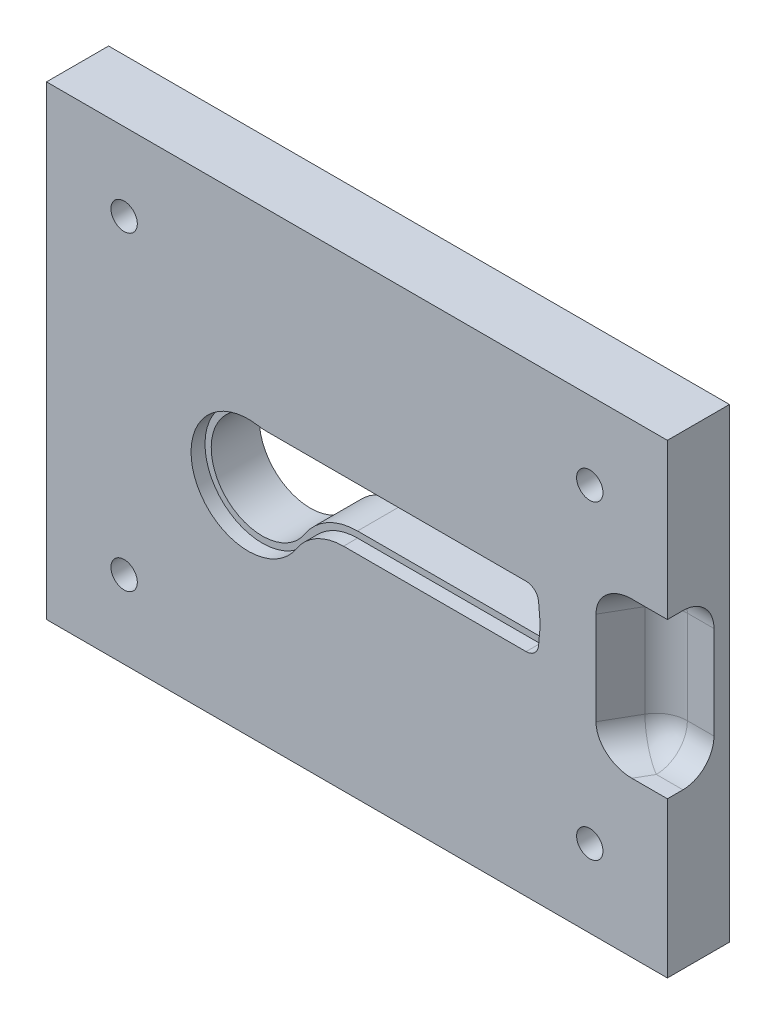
ISO-10303-21;
HEADER;
FILE_DESCRIPTION(('STEP AP214'),'2;1');
FILE_NAME('part.step','',(''),(''),'','','');
FILE_SCHEMA(('AUTOMOTIVE_DESIGN { 1 0 10303 214 1 1 1 1 }'));
ENDSEC;
DATA;
#1=APPLICATION_CONTEXT('core data for automotive mechanical design processes');
#2=APPLICATION_PROTOCOL_DEFINITION('international standard','automotive_design',2000,#1);
#3=PRODUCT_CONTEXT('',#1,'mechanical');
#4=PRODUCT('Part','Part','',(#3));
#5=PRODUCT_RELATED_PRODUCT_CATEGORY('part','',(#4));
#6=PRODUCT_DEFINITION_FORMATION('','',#4);
#7=PRODUCT_DEFINITION_CONTEXT('part definition',#1,'design');
#8=PRODUCT_DEFINITION('design','',#6,#7);
#9=PRODUCT_DEFINITION_SHAPE('','',#8);
#10=(LENGTH_UNIT() NAMED_UNIT(*) SI_UNIT(.MILLI.,.METRE.));
#11=(NAMED_UNIT(*) PLANE_ANGLE_UNIT() SI_UNIT($,.RADIAN.));
#12=(NAMED_UNIT(*) SI_UNIT($,.STERADIAN.) SOLID_ANGLE_UNIT());
#13=UNCERTAINTY_MEASURE_WITH_UNIT(LENGTH_MEASURE(1.E-05),#10,'distance_accuracy_value','');
#14=(GEOMETRIC_REPRESENTATION_CONTEXT(3) GLOBAL_UNCERTAINTY_ASSIGNED_CONTEXT((#13)) GLOBAL_UNIT_ASSIGNED_CONTEXT((#10,
#11,#12)) REPRESENTATION_CONTEXT('',''));
#15=CARTESIAN_POINT('',(0.,0.,0.));
#16=DIRECTION('',(0.,0.,1.));
#17=DIRECTION('',(1.,0.,0.));
#18=AXIS2_PLACEMENT_3D('',#15,#16,#17);
#19=CARTESIAN_POINT('',(175.,125.,20.));
#20=DIRECTION('',(0.,0.,1.));
#21=DIRECTION('',(1.,0.,0.));
#22=AXIS2_PLACEMENT_3D('',#19,#20,#21);
#23=CYLINDRICAL_SURFACE('',#22,4.24999999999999);
#24=CARTESIAN_POINT('',(175.,125.,20.));
#25=DIRECTION('',(0.,0.,1.));
#26=DIRECTION('',(1.,0.,0.));
#27=AXIS2_PLACEMENT_3D('',#24,#25,#26);
#28=CIRCLE('',#27,4.24999999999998);
#29=CARTESIAN_POINT('',(179.25,125.,20.));
#30=VERTEX_POINT('',#29);
#31=EDGE_CURVE('E268',#30,#30,#28,.T.);
#32=ORIENTED_EDGE('',*,*,#31,.T.);
#33=EDGE_LOOP('',(#32));
#34=FACE_BOUND('',#33,.T.);
#35=CARTESIAN_POINT('',(175.,125.,5.));
#36=DIRECTION('',(0.,0.,-1.));
#37=DIRECTION('',(-1.,0.,0.));
#38=AXIS2_PLACEMENT_3D('',#35,#36,#37);
#39=CIRCLE('',#38,4.24999999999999);
#40=CARTESIAN_POINT('',(170.75,125.,5.));
#41=VERTEX_POINT('',#40);
#42=EDGE_CURVE('E280',#41,#41,#39,.F.);
#43=ORIENTED_EDGE('',*,*,#42,.F.);
#44=EDGE_LOOP('',(#43));
#45=FACE_BOUND('',#44,.T.);
#46=ADVANCED_FACE('F28',(#34,#45),#23,.F.);
#47=CARTESIAN_POINT('',(175.,25.,20.));
#48=DIRECTION('',(0.,0.,1.));
#49=DIRECTION('',(1.,0.,0.));
#50=AXIS2_PLACEMENT_3D('',#47,#48,#49);
#51=CYLINDRICAL_SURFACE('',#50,4.24999999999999);
#52=CARTESIAN_POINT('',(175.,25.,20.));
#53=DIRECTION('',(0.,0.,1.));
#54=DIRECTION('',(1.,0.,0.));
#55=AXIS2_PLACEMENT_3D('',#52,#53,#54);
#56=CIRCLE('',#55,4.24999999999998);
#57=CARTESIAN_POINT('',(179.25,25.,20.));
#58=VERTEX_POINT('',#57);
#59=EDGE_CURVE('E385',#58,#58,#56,.T.);
#60=ORIENTED_EDGE('',*,*,#59,.T.);
#61=EDGE_LOOP('',(#60));
#62=FACE_BOUND('',#61,.T.);
#63=CARTESIAN_POINT('',(175.,25.,5.));
#64=DIRECTION('',(0.,0.,-1.));
#65=DIRECTION('',(-1.,0.,0.));
#66=AXIS2_PLACEMENT_3D('',#63,#64,#65);
#67=CIRCLE('',#66,4.24999999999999);
#68=CARTESIAN_POINT('',(170.75,25.,5.));
#69=VERTEX_POINT('',#68);
#70=EDGE_CURVE('E275',#69,#69,#67,.F.);
#71=ORIENTED_EDGE('',*,*,#70,.F.);
#72=EDGE_LOOP('',(#71));
#73=FACE_BOUND('',#72,.T.);
#74=ADVANCED_FACE('F573',(#62,#73),#51,.F.);
#75=CARTESIAN_POINT('',(25.,25.,20.));
#76=DIRECTION('',(0.,0.,1.));
#77=DIRECTION('',(1.,0.,0.));
#78=AXIS2_PLACEMENT_3D('',#75,#76,#77);
#79=CYLINDRICAL_SURFACE('',#78,4.24999999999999);
#80=CARTESIAN_POINT('',(25.,25.,20.));
#81=DIRECTION('',(0.,0.,1.));
#82=DIRECTION('',(1.,0.,0.));
#83=AXIS2_PLACEMENT_3D('',#80,#81,#82);
#84=CIRCLE('',#83,4.24999999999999);
#85=CARTESIAN_POINT('',(29.25,25.,20.));
#86=VERTEX_POINT('',#85);
#87=EDGE_CURVE('E382',#86,#86,#84,.T.);
#88=ORIENTED_EDGE('',*,*,#87,.T.);
#89=EDGE_LOOP('',(#88));
#90=FACE_BOUND('',#89,.T.);
#91=CARTESIAN_POINT('',(25.,25.,5.));
#92=DIRECTION('',(0.,0.,-1.));
#93=DIRECTION('',(-1.,0.,0.));
#94=AXIS2_PLACEMENT_3D('',#91,#92,#93);
#95=CIRCLE('',#94,4.24999999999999);
#96=CARTESIAN_POINT('',(20.75,25.,5.));
#97=VERTEX_POINT('',#96);
#98=EDGE_CURVE('E270',#97,#97,#95,.F.);
#99=ORIENTED_EDGE('',*,*,#98,.F.);
#100=EDGE_LOOP('',(#99));
#101=FACE_BOUND('',#100,.T.);
#102=ADVANCED_FACE('F579',(#90,#101),#79,.F.);
#103=CARTESIAN_POINT('',(25.,125.,20.));
#104=DIRECTION('',(0.,0.,1.));
#105=DIRECTION('',(1.,0.,0.));
#106=AXIS2_PLACEMENT_3D('',#103,#104,#105);
#107=CYLINDRICAL_SURFACE('',#106,4.24999999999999);
#108=CARTESIAN_POINT('',(25.,125.,20.));
#109=DIRECTION('',(0.,0.,1.));
#110=DIRECTION('',(1.,0.,0.));
#111=AXIS2_PLACEMENT_3D('',#108,#109,#110);
#112=CIRCLE('',#111,4.24999999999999);
#113=CARTESIAN_POINT('',(29.25,125.,20.));
#114=VERTEX_POINT('',#113);
#115=EDGE_CURVE('E379',#114,#114,#112,.T.);
#116=ORIENTED_EDGE('',*,*,#115,.T.);
#117=EDGE_LOOP('',(#116));
#118=FACE_BOUND('',#117,.T.);
#119=CARTESIAN_POINT('',(25.,125.,5.));
#120=DIRECTION('',(0.,0.,-1.));
#121=DIRECTION('',(-1.,0.,0.));
#122=AXIS2_PLACEMENT_3D('',#119,#120,#121);
#123=CIRCLE('',#122,4.24999999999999);
#124=CARTESIAN_POINT('',(20.75,125.,5.));
#125=VERTEX_POINT('',#124);
#126=EDGE_CURVE('E265',#125,#125,#123,.F.);
#127=ORIENTED_EDGE('',*,*,#126,.F.);
#128=EDGE_LOOP('',(#127));
#129=FACE_BOUND('',#128,.T.);
#130=ADVANCED_FACE('F587',(#118,#129),#107,.F.);
#131=CARTESIAN_POINT('',(0.,150.,0.));
#132=DIRECTION('',(0.,0.,-1.));
#133=DIRECTION('',(-1.,0.,0.));
#134=AXIS2_PLACEMENT_3D('',#131,#132,#133);
#135=PLANE('',#134);
#136=CARTESIAN_POINT('',(175.,125.,0.));
#137=DIRECTION('',(0.,0.,-1.));
#138=DIRECTION('',(-1.,0.,0.));
#139=AXIS2_PLACEMENT_3D('',#136,#137,#138);
#140=CIRCLE('',#139,13.);
#141=CARTESIAN_POINT('',(162.,125.,0.));
#142=VERTEX_POINT('',#141);
#143=EDGE_CURVE('E228',#142,#142,#140,.T.);
#144=ORIENTED_EDGE('',*,*,#143,.F.);
#145=EDGE_LOOP('',(#144));
#146=FACE_BOUND('',#145,.T.);
#147=CARTESIAN_POINT('',(175.,25.,0.));
#148=DIRECTION('',(0.,0.,-1.));
#149=DIRECTION('',(-1.,0.,0.));
#150=AXIS2_PLACEMENT_3D('',#147,#148,#149);
#151=CIRCLE('',#150,13.);
#152=CARTESIAN_POINT('',(162.,25.,0.));
#153=VERTEX_POINT('',#152);
#154=EDGE_CURVE('E283',#153,#153,#151,.T.);
#155=ORIENTED_EDGE('',*,*,#154,.F.);
#156=EDGE_LOOP('',(#155));
#157=FACE_BOUND('',#156,.T.);
#158=CARTESIAN_POINT('',(25.,25.,0.));
#159=DIRECTION('',(0.,0.,-1.));
#160=DIRECTION('',(-1.,0.,0.));
#161=AXIS2_PLACEMENT_3D('',#158,#159,#160);
#162=CIRCLE('',#161,13.);
#163=CARTESIAN_POINT('',(12.,25.,0.));
#164=VERTEX_POINT('',#163);
#165=EDGE_CURVE('E278',#164,#164,#162,.T.);
#166=ORIENTED_EDGE('',*,*,#165,.F.);
#167=EDGE_LOOP('',(#166));
#168=FACE_BOUND('',#167,.T.);
#169=CARTESIAN_POINT('',(25.,125.,0.));
#170=DIRECTION('',(0.,0.,-1.));
#171=DIRECTION('',(-1.,0.,0.));
#172=AXIS2_PLACEMENT_3D('',#169,#170,#171);
#173=CIRCLE('',#172,13.);
#174=CARTESIAN_POINT('',(12.,125.,0.));
#175=VERTEX_POINT('',#174);
#176=EDGE_CURVE('E273',#175,#175,#173,.T.);
#177=ORIENTED_EDGE('',*,*,#176,.F.);
#178=EDGE_LOOP('',(#177));
#179=FACE_BOUND('',#178,.T.);
#180=CARTESIAN_POINT('',(71.0781905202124,105.965,0.));
#181=DIRECTION('',(0.,0.,-1.));
#182=DIRECTION('',(-1.,0.,0.));
#183=AXIS2_PLACEMENT_3D('',#180,#181,#182);
#184=CIRCLE('',#183,20.03);
#185=CARTESIAN_POINT('',(71.0781905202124,85.935,0.));
#186=VERTEX_POINT('',#185);
#187=CARTESIAN_POINT('',(67.7403932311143,86.2150630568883,0.));
#188=VERTEX_POINT('',#187);
#189=EDGE_CURVE('E476',#186,#188,#184,.T.);
#190=ORIENTED_EDGE('',*,*,#189,.T.);
#191=CARTESIAN_POINT('',(65.,70.,0.));
#192=DIRECTION('',(0.,0.,1.));
#193=DIRECTION('',(1.,0.,0.));
#194=AXIS2_PLACEMENT_3D('',#191,#192,#193);
#195=CIRCLE('',#194,16.445);
#196=CARTESIAN_POINT('',(78.8329287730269,61.1068505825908,0.));
#197=VERTEX_POINT('',#196);
#198=EDGE_CURVE('E479',#188,#197,#195,.T.);
#199=ORIENTED_EDGE('',*,*,#198,.T.);
#200=CARTESIAN_POINT('',(95.6814276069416,50.275,0.));
#201=DIRECTION('',(0.,0.,-1.));
#202=DIRECTION('',(1.,0.,0.));
#203=AXIS2_PLACEMENT_3D('',#200,#201,#202);
#204=CIRCLE('',#203,20.03);
#205=CARTESIAN_POINT('',(95.6814276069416,70.305,0.));
#206=VERTEX_POINT('',#205);
#207=EDGE_CURVE('E482',#197,#206,#204,.T.);
#208=ORIENTED_EDGE('',*,*,#207,.T.);
#209=DIRECTION('',(1.,0.,0.));
#210=VECTOR('',#209,1.);
#211=CARTESIAN_POINT('',(95.6814276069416,70.305,0.));
#212=LINE('',#211,#210);
#213=CARTESIAN_POINT('',(154.489847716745,70.305,0.));
#214=VERTEX_POINT('',#213);
#215=EDGE_CURVE('E485',#206,#214,#212,.T.);
#216=ORIENTED_EDGE('',*,*,#215,.T.);
#217=CARTESIAN_POINT('',(154.489847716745,72.335,0.));
#218=DIRECTION('',(0.,0.,1.));
#219=DIRECTION('',(1.,0.,0.));
#220=AXIS2_PLACEMENT_3D('',#217,#218,#219);
#221=CIRCLE('',#220,2.03);
#222=CARTESIAN_POINT('',(156.512122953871,72.1580738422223,0.));
#223=VERTEX_POINT('',#222);
#224=EDGE_CURVE('E488',#214,#223,#221,.T.);
#225=ORIENTED_EDGE('',*,*,#224,.T.);
#226=DIRECTION('',(0.0871557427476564,0.996194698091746,0.));
#227=VECTOR('',#226,1.);
#228=CARTESIAN_POINT('',(156.512122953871,72.1580738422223,0.));
#229=LINE('',#228,#227);
#230=CARTESIAN_POINT('',(157.033723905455,78.12,0.));
#231=VERTEX_POINT('',#230);
#232=EDGE_CURVE('E491',#223,#231,#229,.T.);
#233=ORIENTED_EDGE('',*,*,#232,.T.);
#234=DIRECTION('',(-0.0871557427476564,0.996194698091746,0.));
#235=VECTOR('',#234,1.);
#236=CARTESIAN_POINT('',(156.512122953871,84.0819261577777,0.));
#237=LINE('',#236,#235);
#238=CARTESIAN_POINT('',(156.512122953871,84.0819261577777,0.));
#239=VERTEX_POINT('',#238);
#240=EDGE_CURVE('E494',#231,#239,#237,.T.);
#241=ORIENTED_EDGE('',*,*,#240,.T.);
#242=CARTESIAN_POINT('',(154.489847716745,83.905,0.));
#243=DIRECTION('',(0.,0.,1.));
#244=DIRECTION('',(-1.,0.,0.));
#245=AXIS2_PLACEMENT_3D('',#242,#243,#244);
#246=CIRCLE('',#245,2.03);
#247=CARTESIAN_POINT('',(154.489847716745,85.935,0.));
#248=VERTEX_POINT('',#247);
#249=EDGE_CURVE('E497',#239,#248,#246,.T.);
#250=ORIENTED_EDGE('',*,*,#249,.T.);
#251=DIRECTION('',(-1.,0.,0.));
#252=VECTOR('',#251,1.);
#253=CARTESIAN_POINT('',(71.0781905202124,85.935,0.));
#254=LINE('',#253,#252);
#255=EDGE_CURVE('E500',#248,#186,#254,.T.);
#256=ORIENTED_EDGE('',*,*,#255,.T.);
#257=EDGE_LOOP('',(#190,#199,#208,#216,#225,#233,#241,#250,#256));
#258=FACE_BOUND('',#257,.T.);
#259=DIRECTION('',(0.,-1.,0.));
#260=VECTOR('',#259,1.);
#261=CARTESIAN_POINT('',(0.,0.,0.));
#262=LINE('',#261,#260);
#263=CARTESIAN_POINT('',(0.,150.,0.));
#264=VERTEX_POINT('',#263);
#265=CARTESIAN_POINT('',(0.,0.,0.));
#266=VERTEX_POINT('',#265);
#267=EDGE_CURVE('E507',#264,#266,#262,.T.);
#268=ORIENTED_EDGE('',*,*,#267,.F.);
#269=DIRECTION('',(-1.,0.,0.));
#270=VECTOR('',#269,1.);
#271=CARTESIAN_POINT('',(0.,150.,0.));
#272=LINE('',#271,#270);
#273=CARTESIAN_POINT('',(200.,150.,0.));
#274=VERTEX_POINT('',#273);
#275=EDGE_CURVE('E537',#274,#264,#272,.T.);
#276=ORIENTED_EDGE('',*,*,#275,.F.);
#277=DIRECTION('',(0.,1.,0.));
#278=VECTOR('',#277,1.);
#279=CARTESIAN_POINT('',(200.,0.,0.));
#280=LINE('',#279,#278);
#281=CARTESIAN_POINT('',(200.,0.,0.));
#282=VERTEX_POINT('',#281);
#283=EDGE_CURVE('E535',#282,#274,#280,.T.);
#284=ORIENTED_EDGE('',*,*,#283,.F.);
#285=DIRECTION('',(1.,0.,0.));
#286=VECTOR('',#285,1.);
#287=CARTESIAN_POINT('',(0.,0.,0.));
#288=LINE('',#287,#286);
#289=EDGE_CURVE('E533',#266,#282,#288,.T.);
#290=ORIENTED_EDGE('',*,*,#289,.F.);
#291=EDGE_LOOP('',(#268,#276,#284,#290));
#292=FACE_BOUND('',#291,.T.);
#293=ADVANCED_FACE('F552',(#146,#157,#168,#179,#258,#292),#135,.T.);
#294=CARTESIAN_POINT('',(71.0781905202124,105.965,0.));
#295=DIRECTION('',(0.,0.,1.));
#296=DIRECTION('',(1.,0.,0.));
#297=AXIS2_PLACEMENT_3D('',#294,#295,#296);
#298=CYLINDRICAL_SURFACE('',#297,20.03);
#299=CARTESIAN_POINT('',(71.0781905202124,105.965,15.5));
#300=DIRECTION('',(0.,0.,1.));
#301=DIRECTION('',(1.,0.,0.));
#302=AXIS2_PLACEMENT_3D('',#299,#300,#301);
#303=CIRCLE('',#302,20.03);
#304=CARTESIAN_POINT('',(67.7403932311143,86.2150630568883,15.5));
#305=VERTEX_POINT('',#304);
#306=CARTESIAN_POINT('',(71.0781905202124,85.935,15.5));
#307=VERTEX_POINT('',#306);
#308=EDGE_CURVE('E474',#305,#307,#303,.T.);
#309=ORIENTED_EDGE('',*,*,#308,.F.);
#310=DIRECTION('',(0.,0.,1.));
#311=VECTOR('',#310,1.);
#312=CARTESIAN_POINT('',(67.7403932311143,86.2150630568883,0.));
#313=LINE('',#312,#311);
#314=EDGE_CURVE('E503',#188,#305,#313,.T.);
#315=ORIENTED_EDGE('',*,*,#314,.F.);
#316=ORIENTED_EDGE('',*,*,#189,.F.);
#317=DIRECTION('',(0.,0.,1.));
#318=VECTOR('',#317,1.);
#319=CARTESIAN_POINT('',(71.0781905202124,85.935,0.));
#320=LINE('',#319,#318);
#321=EDGE_CURVE('E504',#186,#307,#320,.T.);
#322=ORIENTED_EDGE('',*,*,#321,.T.);
#323=EDGE_LOOP('',(#309,#315,#316,#322));
#324=FACE_BOUND('',#323,.T.);
#325=ADVANCED_FACE('F639',(#324),#298,.T.);
#326=CARTESIAN_POINT('',(71.0781905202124,85.935,0.));
#327=DIRECTION('',(0.,1.,0.));
#328=DIRECTION('',(-1.,0.,0.));
#329=AXIS2_PLACEMENT_3D('',#326,#327,#328);
#330=PLANE('',#329);
#331=DIRECTION('',(1.,0.,0.));
#332=VECTOR('',#331,1.);
#333=CARTESIAN_POINT('',(71.0781905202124,85.935,15.5));
#334=LINE('',#333,#332);
#335=CARTESIAN_POINT('',(154.489847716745,85.935,15.5));
#336=VERTEX_POINT('',#335);
#337=EDGE_CURVE('E472',#307,#336,#334,.T.);
#338=ORIENTED_EDGE('',*,*,#337,.F.);
#339=ORIENTED_EDGE('',*,*,#321,.F.);
#340=ORIENTED_EDGE('',*,*,#255,.F.);
#341=DIRECTION('',(0.,0.,1.));
#342=VECTOR('',#341,1.);
#343=CARTESIAN_POINT('',(154.489847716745,85.935,0.));
#344=LINE('',#343,#342);
#345=EDGE_CURVE('E508',#248,#336,#344,.T.);
#346=ORIENTED_EDGE('',*,*,#345,.T.);
#347=EDGE_LOOP('',(#338,#339,#340,#346));
#348=FACE_BOUND('',#347,.T.);
#349=ADVANCED_FACE('F635',(#348),#330,.F.);
#350=CARTESIAN_POINT('',(154.489847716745,83.905,0.));
#351=DIRECTION('',(0.,0.,1.));
#352=DIRECTION('',(1.,0.,0.));
#353=AXIS2_PLACEMENT_3D('',#350,#351,#352);
#354=CYLINDRICAL_SURFACE('',#353,2.03);
#355=CARTESIAN_POINT('',(154.489847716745,83.905,15.5));
#356=DIRECTION('',(0.,0.,1.));
#357=DIRECTION('',(1.,0.,0.));
#358=AXIS2_PLACEMENT_3D('',#355,#356,#357);
#359=CIRCLE('',#358,2.03);
#360=CARTESIAN_POINT('',(156.512122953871,84.0819261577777,15.5));
#361=VERTEX_POINT('',#360);
#362=EDGE_CURVE('E470',#336,#361,#359,.F.);
#363=ORIENTED_EDGE('',*,*,#362,.F.);
#364=ORIENTED_EDGE('',*,*,#345,.F.);
#365=ORIENTED_EDGE('',*,*,#249,.F.);
#366=DIRECTION('',(0.,0.,1.));
#367=VECTOR('',#366,1.);
#368=CARTESIAN_POINT('',(156.512122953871,84.0819261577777,0.));
#369=LINE('',#368,#367);
#370=EDGE_CURVE('E511',#239,#361,#369,.T.);
#371=ORIENTED_EDGE('',*,*,#370,.T.);
#372=EDGE_LOOP('',(#363,#364,#365,#371));
#373=FACE_BOUND('',#372,.T.);
#374=ADVANCED_FACE('F638',(#373),#354,.F.);
#375=CARTESIAN_POINT('',(156.512122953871,84.0819261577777,0.));
#376=DIRECTION('',(0.996194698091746,0.0871557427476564,0.));
#377=DIRECTION('',(-0.0871557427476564,0.996194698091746,0.));
#378=AXIS2_PLACEMENT_3D('',#375,#376,#377);
#379=PLANE('',#378);
#380=DIRECTION('',(0.0871557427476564,-0.996194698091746,0.));
#381=VECTOR('',#380,1.);
#382=CARTESIAN_POINT('',(156.512122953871,84.0819261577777,15.5));
#383=LINE('',#382,#381);
#384=CARTESIAN_POINT('',(157.033723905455,78.12,15.5));
#385=VERTEX_POINT('',#384);
#386=EDGE_CURVE('E468',#361,#385,#383,.T.);
#387=ORIENTED_EDGE('',*,*,#386,.F.);
#388=ORIENTED_EDGE('',*,*,#370,.F.);
#389=ORIENTED_EDGE('',*,*,#240,.F.);
#390=DIRECTION('',(0.,0.,1.));
#391=VECTOR('',#390,1.);
#392=CARTESIAN_POINT('',(157.033723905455,78.12,0.));
#393=LINE('',#392,#391);
#394=EDGE_CURVE('E514',#231,#385,#393,.T.);
#395=ORIENTED_EDGE('',*,*,#394,.T.);
#396=EDGE_LOOP('',(#387,#388,#389,#395));
#397=FACE_BOUND('',#396,.T.);
#398=ADVANCED_FACE('F643',(#397),#379,.F.);
#399=CARTESIAN_POINT('',(156.512122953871,72.1580738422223,0.));
#400=DIRECTION('',(0.996194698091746,-0.0871557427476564,0.));
#401=DIRECTION('',(0.0871557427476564,0.996194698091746,0.));
#402=AXIS2_PLACEMENT_3D('',#399,#400,#401);
#403=PLANE('',#402);
#404=DIRECTION('',(-0.0871557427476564,-0.996194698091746,0.));
#405=VECTOR('',#404,1.);
#406=CARTESIAN_POINT('',(156.512122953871,72.1580738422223,15.5));
#407=LINE('',#406,#405);
#408=CARTESIAN_POINT('',(156.512122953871,72.1580738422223,15.5));
#409=VERTEX_POINT('',#408);
#410=EDGE_CURVE('E466',#385,#409,#407,.T.);
#411=ORIENTED_EDGE('',*,*,#410,.F.);
#412=ORIENTED_EDGE('',*,*,#394,.F.);
#413=ORIENTED_EDGE('',*,*,#232,.F.);
#414=DIRECTION('',(0.,0.,1.));
#415=VECTOR('',#414,1.);
#416=CARTESIAN_POINT('',(156.512122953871,72.1580738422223,0.));
#417=LINE('',#416,#415);
#418=EDGE_CURVE('E517',#223,#409,#417,.T.);
#419=ORIENTED_EDGE('',*,*,#418,.T.);
#420=EDGE_LOOP('',(#411,#412,#413,#419));
#421=FACE_BOUND('',#420,.T.);
#422=ADVANCED_FACE('F647',(#421),#403,.F.);
#423=CARTESIAN_POINT('',(154.489847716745,72.335,0.));
#424=DIRECTION('',(0.,0.,1.));
#425=DIRECTION('',(1.,0.,0.));
#426=AXIS2_PLACEMENT_3D('',#423,#424,#425);
#427=CYLINDRICAL_SURFACE('',#426,2.03);
#428=CARTESIAN_POINT('',(154.489847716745,72.335,15.5));
#429=DIRECTION('',(0.,0.,1.));
#430=DIRECTION('',(1.,0.,0.));
#431=AXIS2_PLACEMENT_3D('',#428,#429,#430);
#432=CIRCLE('',#431,2.03);
#433=CARTESIAN_POINT('',(154.489847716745,70.305,15.5));
#434=VERTEX_POINT('',#433);
#435=EDGE_CURVE('E464',#409,#434,#432,.F.);
#436=ORIENTED_EDGE('',*,*,#435,.F.);
#437=ORIENTED_EDGE('',*,*,#418,.F.);
#438=ORIENTED_EDGE('',*,*,#224,.F.);
#439=DIRECTION('',(0.,0.,1.));
#440=VECTOR('',#439,1.);
#441=CARTESIAN_POINT('',(154.489847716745,70.305,0.));
#442=LINE('',#441,#440);
#443=EDGE_CURVE('E520',#214,#434,#442,.T.);
#444=ORIENTED_EDGE('',*,*,#443,.T.);
#445=EDGE_LOOP('',(#436,#437,#438,#444));
#446=FACE_BOUND('',#445,.T.);
#447=ADVANCED_FACE('F651',(#446),#427,.F.);
#448=CARTESIAN_POINT('',(95.6814276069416,70.305,0.));
#449=DIRECTION('',(0.,-1.,0.));
#450=DIRECTION('',(1.,0.,0.));
#451=AXIS2_PLACEMENT_3D('',#448,#449,#450);
#452=PLANE('',#451);
#453=DIRECTION('',(-1.,0.,0.));
#454=VECTOR('',#453,1.);
#455=CARTESIAN_POINT('',(95.6814276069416,70.305,15.5));
#456=LINE('',#455,#454);
#457=CARTESIAN_POINT('',(95.6814276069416,70.305,15.5));
#458=VERTEX_POINT('',#457);
#459=EDGE_CURVE('E462',#434,#458,#456,.T.);
#460=ORIENTED_EDGE('',*,*,#459,.F.);
#461=ORIENTED_EDGE('',*,*,#443,.F.);
#462=ORIENTED_EDGE('',*,*,#215,.F.);
#463=DIRECTION('',(0.,0.,1.));
#464=VECTOR('',#463,1.);
#465=CARTESIAN_POINT('',(95.6814276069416,70.305,0.));
#466=LINE('',#465,#464);
#467=EDGE_CURVE('E523',#206,#458,#466,.T.);
#468=ORIENTED_EDGE('',*,*,#467,.T.);
#469=EDGE_LOOP('',(#460,#461,#462,#468));
#470=FACE_BOUND('',#469,.T.);
#471=ADVANCED_FACE('F655',(#470),#452,.F.);
#472=CARTESIAN_POINT('',(95.6814276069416,50.275,0.));
#473=DIRECTION('',(0.,0.,1.));
#474=DIRECTION('',(1.,0.,0.));
#475=AXIS2_PLACEMENT_3D('',#472,#473,#474);
#476=CYLINDRICAL_SURFACE('',#475,20.03);
#477=CARTESIAN_POINT('',(95.6814276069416,50.275,15.5));
#478=DIRECTION('',(0.,0.,1.));
#479=DIRECTION('',(1.,0.,0.));
#480=AXIS2_PLACEMENT_3D('',#477,#478,#479);
#481=CIRCLE('',#480,20.03);
#482=CARTESIAN_POINT('',(78.8329287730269,61.1068505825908,15.5));
#483=VERTEX_POINT('',#482);
#484=EDGE_CURVE('E444',#458,#483,#481,.T.);
#485=ORIENTED_EDGE('',*,*,#484,.F.);
#486=ORIENTED_EDGE('',*,*,#467,.F.);
#487=ORIENTED_EDGE('',*,*,#207,.F.);
#488=DIRECTION('',(0.,0.,1.));
#489=VECTOR('',#488,1.);
#490=CARTESIAN_POINT('',(78.8329287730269,61.1068505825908,0.));
#491=LINE('',#490,#489);
#492=EDGE_CURVE('E526',#197,#483,#491,.T.);
#493=ORIENTED_EDGE('',*,*,#492,.T.);
#494=EDGE_LOOP('',(#485,#486,#487,#493));
#495=FACE_BOUND('',#494,.T.);
#496=ADVANCED_FACE('F659',(#495),#476,.T.);
#497=CARTESIAN_POINT('',(65.,70.,0.));
#498=DIRECTION('',(0.,0.,1.));
#499=DIRECTION('',(1.,0.,0.));
#500=AXIS2_PLACEMENT_3D('',#497,#498,#499);
#501=CYLINDRICAL_SURFACE('',#500,16.445);
#502=CARTESIAN_POINT('',(65.,70.,15.5));
#503=DIRECTION('',(0.,0.,1.));
#504=DIRECTION('',(1.,0.,0.));
#505=AXIS2_PLACEMENT_3D('',#502,#503,#504);
#506=CIRCLE('',#505,16.445);
#507=EDGE_CURVE('E262',#483,#305,#506,.F.);
#508=ORIENTED_EDGE('',*,*,#507,.F.);
#509=ORIENTED_EDGE('',*,*,#492,.F.);
#510=ORIENTED_EDGE('',*,*,#198,.F.);
#511=ORIENTED_EDGE('',*,*,#314,.T.);
#512=EDGE_LOOP('',(#508,#509,#510,#511));
#513=FACE_BOUND('',#512,.T.);
#514=ADVANCED_FACE('F663',(#513),#501,.F.);
#515=CARTESIAN_POINT('',(0.,0.,20.));
#516=DIRECTION('',(1.,0.,0.));
#517=DIRECTION('',(0.,0.,-1.));
#518=AXIS2_PLACEMENT_3D('',#515,#516,#517);
#519=PLANE('',#518);
#520=ORIENTED_EDGE('',*,*,#267,.T.);
#521=DIRECTION('',(0.,0.,-1.));
#522=VECTOR('',#521,1.);
#523=CARTESIAN_POINT('',(0.,0.,20.));
#524=LINE('',#523,#522);
#525=CARTESIAN_POINT('',(0.,0.,20.));
#526=VERTEX_POINT('',#525);
#527=EDGE_CURVE('E259',#526,#266,#524,.T.);
#528=ORIENTED_EDGE('',*,*,#527,.F.);
#529=DIRECTION('',(0.,-1.,0.));
#530=VECTOR('',#529,1.);
#531=CARTESIAN_POINT('',(0.,0.,20.));
#532=LINE('',#531,#530);
#533=CARTESIAN_POINT('',(0.,150.,20.));
#534=VERTEX_POINT('',#533);
#535=EDGE_CURVE('E538',#534,#526,#532,.T.);
#536=ORIENTED_EDGE('',*,*,#535,.F.);
#537=DIRECTION('',(0.,0.,-1.));
#538=VECTOR('',#537,1.);
#539=CARTESIAN_POINT('',(0.,150.,20.));
#540=LINE('',#539,#538);
#541=EDGE_CURVE('E247',#534,#264,#540,.T.);
#542=ORIENTED_EDGE('',*,*,#541,.T.);
#543=EDGE_LOOP('',(#520,#528,#536,#542));
#544=FACE_BOUND('',#543,.T.);
#545=ADVANCED_FACE('F544',(#544),#519,.F.);
#546=CARTESIAN_POINT('',(0.,0.,20.));
#547=DIRECTION('',(0.,1.,0.));
#548=DIRECTION('',(0.,0.,1.));
#549=AXIS2_PLACEMENT_3D('',#546,#547,#548);
#550=PLANE('',#549);
#551=ORIENTED_EDGE('',*,*,#289,.T.);
#552=DIRECTION('',(0.,0.,-1.));
#553=VECTOR('',#552,1.);
#554=CARTESIAN_POINT('',(200.,0.,20.));
#555=LINE('',#554,#553);
#556=CARTESIAN_POINT('',(200.,0.,20.));
#557=VERTEX_POINT('',#556);
#558=EDGE_CURVE('E257',#557,#282,#555,.T.);
#559=ORIENTED_EDGE('',*,*,#558,.F.);
#560=DIRECTION('',(1.,0.,0.));
#561=VECTOR('',#560,1.);
#562=CARTESIAN_POINT('',(0.,0.,20.));
#563=LINE('',#562,#561);
#564=EDGE_CURVE('E242',#526,#557,#563,.T.);
#565=ORIENTED_EDGE('',*,*,#564,.F.);
#566=ORIENTED_EDGE('',*,*,#527,.T.);
#567=EDGE_LOOP('',(#551,#559,#565,#566));
#568=FACE_BOUND('',#567,.T.);
#569=ADVANCED_FACE('F547',(#568),#550,.F.);
#570=CARTESIAN_POINT('',(200.,0.,20.));
#571=DIRECTION('',(-1.,0.,0.));
#572=DIRECTION('',(0.,0.,1.));
#573=AXIS2_PLACEMENT_3D('',#570,#571,#572);
#574=PLANE('',#573);
#575=DIRECTION('',(0.,1.,0.));
#576=VECTOR('',#575,1.);
#577=CARTESIAN_POINT('',(200.,100.,5.));
#578=LINE('',#577,#576);
#579=CARTESIAN_POINT('',(200.,60.,5.));
#580=VERTEX_POINT('',#579);
#581=CARTESIAN_POINT('',(200.,90.,5.));
#582=VERTEX_POINT('',#581);
#583=EDGE_CURVE('E237',#580,#582,#578,.T.);
#584=ORIENTED_EDGE('',*,*,#583,.F.);
#585=CARTESIAN_POINT('',(200.,60.,15.));
#586=DIRECTION('',(-1.,0.,0.));
#587=DIRECTION('',(0.,0.,1.));
#588=AXIS2_PLACEMENT_3D('',#585,#586,#587);
#589=CIRCLE('',#588,10.);
#590=CARTESIAN_POINT('',(200.,50.,15.));
#591=VERTEX_POINT('',#590);
#592=EDGE_CURVE('E11',#580,#591,#589,.T.);
#593=ORIENTED_EDGE('',*,*,#592,.T.);
#594=DIRECTION('',(0.,0.,1.));
#595=VECTOR('',#594,1.);
#596=CARTESIAN_POINT('',(200.,50.,5.));
#597=LINE('',#596,#595);
#598=CARTESIAN_POINT('',(200.,50.,20.));
#599=VERTEX_POINT('',#598);
#600=EDGE_CURVE('E222',#591,#599,#597,.T.);
#601=ORIENTED_EDGE('',*,*,#600,.T.);
#602=DIRECTION('',(0.,1.,0.));
#603=VECTOR('',#602,1.);
#604=CARTESIAN_POINT('',(200.,0.,20.));
#605=LINE('',#604,#603);
#606=EDGE_CURVE('E227',#557,#599,#605,.T.);
#607=ORIENTED_EDGE('',*,*,#606,.F.);
#608=ORIENTED_EDGE('',*,*,#558,.T.);
#609=ORIENTED_EDGE('',*,*,#283,.T.);
#610=DIRECTION('',(0.,0.,-1.));
#611=VECTOR('',#610,1.);
#612=CARTESIAN_POINT('',(200.,150.,20.));
#613=LINE('',#612,#611);
#614=CARTESIAN_POINT('',(200.,150.,20.));
#615=VERTEX_POINT('',#614);
#616=EDGE_CURVE('E254',#615,#274,#613,.T.);
#617=ORIENTED_EDGE('',*,*,#616,.F.);
#618=CARTESIAN_POINT('',(200.,100.,20.));
#619=VERTEX_POINT('',#618);
#620=EDGE_CURVE('E245',#619,#615,#605,.T.);
#621=ORIENTED_EDGE('',*,*,#620,.F.);
#622=DIRECTION('',(0.,0.,1.));
#623=VECTOR('',#622,1.);
#624=CARTESIAN_POINT('',(200.,100.,5.));
#625=LINE('',#624,#623);
#626=CARTESIAN_POINT('',(200.,100.,15.));
#627=VERTEX_POINT('',#626);
#628=EDGE_CURVE('E229',#627,#619,#625,.T.);
#629=ORIENTED_EDGE('',*,*,#628,.F.);
#630=CARTESIAN_POINT('',(200.,90.,15.));
#631=DIRECTION('',(-1.,0.,0.));
#632=DIRECTION('',(0.,0.,1.));
#633=AXIS2_PLACEMENT_3D('',#630,#631,#632);
#634=CIRCLE('',#633,10.);
#635=EDGE_CURVE('E305',#627,#582,#634,.T.);
#636=ORIENTED_EDGE('',*,*,#635,.T.);
#637=EDGE_LOOP('',(#584,#593,#601,#607,#608,#609,#617,#621,#629,#636));
#638=FACE_BOUND('',#637,.T.);
#639=ADVANCED_FACE('F224',(#638),#574,.F.);
#640=CARTESIAN_POINT('',(0.,150.,20.));
#641=DIRECTION('',(0.,-1.,0.));
#642=DIRECTION('',(0.,0.,-1.));
#643=AXIS2_PLACEMENT_3D('',#640,#641,#642);
#644=PLANE('',#643);
#645=ORIENTED_EDGE('',*,*,#275,.T.);
#646=ORIENTED_EDGE('',*,*,#541,.F.);
#647=DIRECTION('',(-1.,0.,0.));
#648=VECTOR('',#647,1.);
#649=CARTESIAN_POINT('',(0.,150.,20.));
#650=LINE('',#649,#648);
#651=EDGE_CURVE('E244',#615,#534,#650,.T.);
#652=ORIENTED_EDGE('',*,*,#651,.F.);
#653=ORIENTED_EDGE('',*,*,#616,.T.);
#654=EDGE_LOOP('',(#645,#646,#652,#653));
#655=FACE_BOUND('',#654,.T.);
#656=ADVANCED_FACE('F554',(#655),#644,.F.);
#657=CARTESIAN_POINT('',(0.,150.,20.));
#658=DIRECTION('',(0.,0.,-1.));
#659=DIRECTION('',(-1.,0.,0.));
#660=AXIS2_PLACEMENT_3D('',#657,#658,#659);
#661=PLANE('',#660);
#662=ORIENTED_EDGE('',*,*,#31,.F.);
#663=EDGE_LOOP('',(#662));
#664=FACE_BOUND('',#663,.T.);
#665=ORIENTED_EDGE('',*,*,#115,.F.);
#666=EDGE_LOOP('',(#665));
#667=FACE_BOUND('',#666,.T.);
#668=ORIENTED_EDGE('',*,*,#87,.F.);
#669=EDGE_LOOP('',(#668));
#670=FACE_BOUND('',#669,.T.);
#671=ORIENTED_EDGE('',*,*,#59,.F.);
#672=EDGE_LOOP('',(#671));
#673=FACE_BOUND('',#672,.T.);
#674=DIRECTION('',(0.0871557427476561,0.996194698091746,0.));
#675=VECTOR('',#674,1.);
#676=CARTESIAN_POINT('',(158.504512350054,71.983762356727,20.));
#677=LINE('',#676,#675);
#678=CARTESIAN_POINT('',(158.504512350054,71.983762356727,20.));
#679=VERTEX_POINT('',#678);
#680=CARTESIAN_POINT('',(159.041363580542,78.12,20.));
#681=VERTEX_POINT('',#680);
#682=EDGE_CURVE('E390',#679,#681,#677,.T.);
#683=ORIENTED_EDGE('',*,*,#682,.F.);
#684=CARTESIAN_POINT('',(154.489847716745,72.335,20.));
#685=DIRECTION('',(0.,0.,1.));
#686=DIRECTION('',(1.,0.,0.));
#687=AXIS2_PLACEMENT_3D('',#684,#685,#686);
#688=CIRCLE('',#687,4.03);
#689=CARTESIAN_POINT('',(154.489847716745,68.305,20.));
#690=VERTEX_POINT('',#689);
#691=EDGE_CURVE('E388',#690,#679,#688,.T.);
#692=ORIENTED_EDGE('',*,*,#691,.F.);
#693=DIRECTION('',(1.,0.,0.));
#694=VECTOR('',#693,1.);
#695=CARTESIAN_POINT('',(95.6814276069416,68.305,20.));
#696=LINE('',#695,#694);
#697=CARTESIAN_POINT('',(95.6814276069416,68.305,20.));
#698=VERTEX_POINT('',#697);
#699=EDGE_CURVE('E411',#698,#690,#696,.T.);
#700=ORIENTED_EDGE('',*,*,#699,.F.);
#701=CARTESIAN_POINT('',(95.6814276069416,50.275,20.));
#702=DIRECTION('',(0.,0.,-1.));
#703=DIRECTION('',(1.,0.,0.));
#704=AXIS2_PLACEMENT_3D('',#701,#702,#703);
#705=CIRCLE('',#704,18.03);
#706=CARTESIAN_POINT('',(80.5152551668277,60.025287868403,20.));
#707=VERTEX_POINT('',#706);
#708=EDGE_CURVE('E408',#707,#698,#705,.T.);
#709=ORIENTED_EDGE('',*,*,#708,.F.);
#710=CARTESIAN_POINT('',(65.,70.,20.));
#711=DIRECTION('',(0.,0.,1.));
#712=DIRECTION('',(1.,0.,0.));
#713=AXIS2_PLACEMENT_3D('',#710,#711,#712);
#714=CIRCLE('',#713,18.445);
#715=CARTESIAN_POINT('',(68.0736730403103,88.1870986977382,20.));
#716=VERTEX_POINT('',#715);
#717=EDGE_CURVE('E405',#716,#707,#714,.T.);
#718=ORIENTED_EDGE('',*,*,#717,.F.);
#719=CARTESIAN_POINT('',(71.0781905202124,105.965,20.));
#720=DIRECTION('',(0.,0.,-1.));
#721=DIRECTION('',(1.,0.,0.));
#722=AXIS2_PLACEMENT_3D('',#719,#720,#721);
#723=CIRCLE('',#722,18.03);
#724=CARTESIAN_POINT('',(71.0781905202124,87.935,20.));
#725=VERTEX_POINT('',#724);
#726=EDGE_CURVE('E402',#725,#716,#723,.T.);
#727=ORIENTED_EDGE('',*,*,#726,.F.);
#728=DIRECTION('',(-1.,0.,0.));
#729=VECTOR('',#728,1.);
#730=CARTESIAN_POINT('',(154.489847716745,87.935,20.));
#731=LINE('',#730,#729);
#732=CARTESIAN_POINT('',(154.489847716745,87.935,20.));
#733=VERTEX_POINT('',#732);
#734=EDGE_CURVE('E399',#733,#725,#731,.T.);
#735=ORIENTED_EDGE('',*,*,#734,.F.);
#736=CARTESIAN_POINT('',(154.489847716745,83.905,20.));
#737=DIRECTION('',(0.,0.,1.));
#738=DIRECTION('',(1.,0.,0.));
#739=AXIS2_PLACEMENT_3D('',#736,#737,#738);
#740=CIRCLE('',#739,4.03);
#741=CARTESIAN_POINT('',(158.504512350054,84.2562376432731,20.));
#742=VERTEX_POINT('',#741);
#743=EDGE_CURVE('E396',#742,#733,#740,.T.);
#744=ORIENTED_EDGE('',*,*,#743,.F.);
#745=DIRECTION('',(-0.0871557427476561,0.996194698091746,0.));
#746=VECTOR('',#745,1.);
#747=CARTESIAN_POINT('',(159.041363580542,78.12,20.));
#748=LINE('',#747,#746);
#749=EDGE_CURVE('E393',#681,#742,#748,.T.);
#750=ORIENTED_EDGE('',*,*,#749,.F.);
#751=EDGE_LOOP('',(#683,#692,#700,#709,#718,#727,#735,#744,#750));
#752=FACE_BOUND('',#751,.T.);
#753=ORIENTED_EDGE('',*,*,#606,.T.);
#754=DIRECTION('',(1.,0.,0.));
#755=VECTOR('',#754,1.);
#756=CARTESIAN_POINT('',(200.,50.,20.));
#757=LINE('',#756,#755);
#758=CARTESIAN_POINT('',(188.547005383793,50.,20.));
#759=VERTEX_POINT('',#758);
#760=EDGE_CURVE('E232',#759,#599,#757,.T.);
#761=ORIENTED_EDGE('',*,*,#760,.F.);
#762=CARTESIAN_POINT('',(188.547005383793,60.,20.));
#763=DIRECTION('',(0.,0.,-1.));
#764=DIRECTION('',(-1.,0.,0.));
#765=AXIS2_PLACEMENT_3D('',#762,#763,#764);
#766=ELLIPSE('',#765,11.5470053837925,10.);
#767=CARTESIAN_POINT('',(177.,60.,20.));
#768=VERTEX_POINT('',#767);
#769=EDGE_CURVE('E36',#759,#768,#766,.T.);
#770=ORIENTED_EDGE('',*,*,#769,.T.);
#771=DIRECTION('',(0.,-1.,0.));
#772=VECTOR('',#771,1.);
#773=CARTESIAN_POINT('',(177.,100.,20.));
#774=LINE('',#773,#772);
#775=CARTESIAN_POINT('',(177.,90.,20.));
#776=VERTEX_POINT('',#775);
#777=EDGE_CURVE('E238',#776,#768,#774,.T.);
#778=ORIENTED_EDGE('',*,*,#777,.F.);
#779=CARTESIAN_POINT('',(188.547005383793,90.,20.));
#780=DIRECTION('',(0.,0.,-1.));
#781=DIRECTION('',(-1.,0.,0.));
#782=AXIS2_PLACEMENT_3D('',#779,#780,#781);
#783=ELLIPSE('',#782,11.5470053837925,10.);
#784=CARTESIAN_POINT('',(188.547005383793,100.,20.));
#785=VERTEX_POINT('',#784);
#786=EDGE_CURVE('E303',#776,#785,#783,.T.);
#787=ORIENTED_EDGE('',*,*,#786,.T.);
#788=DIRECTION('',(-1.,0.,0.));
#789=VECTOR('',#788,1.);
#790=CARTESIAN_POINT('',(200.,100.,20.));
#791=LINE('',#790,#789);
#792=EDGE_CURVE('E313',#619,#785,#791,.T.);
#793=ORIENTED_EDGE('',*,*,#792,.F.);
#794=ORIENTED_EDGE('',*,*,#620,.T.);
#795=ORIENTED_EDGE('',*,*,#651,.T.);
#796=ORIENTED_EDGE('',*,*,#535,.T.);
#797=ORIENTED_EDGE('',*,*,#564,.T.);
#798=EDGE_LOOP('',(#753,#761,#770,#778,#787,#793,#794,#795,#796,#797));
#799=FACE_BOUND('',#798,.T.);
#800=ADVANCED_FACE('F240',(#664,#667,#670,#673,#752,#799),#661,.F.);
#801=CARTESIAN_POINT('',(154.489847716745,72.335,15.5));
#802=DIRECTION('',(0.,0.,1.));
#803=DIRECTION('',(1.,0.,0.));
#804=AXIS2_PLACEMENT_3D('',#801,#802,#803);
#805=PLANE('',#804);
#806=CARTESIAN_POINT('',(154.489847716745,72.335,15.5));
#807=DIRECTION('',(0.,0.,1.));
#808=DIRECTION('',(1.,0.,0.));
#809=AXIS2_PLACEMENT_3D('',#806,#807,#808);
#810=CIRCLE('',#809,4.03);
#811=CARTESIAN_POINT('',(154.489847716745,68.305,15.5));
#812=VERTEX_POINT('',#811);
#813=CARTESIAN_POINT('',(158.504512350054,71.983762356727,15.5));
#814=VERTEX_POINT('',#813);
#815=EDGE_CURVE('E414',#812,#814,#810,.T.);
#816=ORIENTED_EDGE('',*,*,#815,.T.);
#817=DIRECTION('',(0.0871557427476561,0.996194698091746,0.));
#818=VECTOR('',#817,1.);
#819=CARTESIAN_POINT('',(158.504512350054,71.983762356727,15.5));
#820=LINE('',#819,#818);
#821=CARTESIAN_POINT('',(159.041363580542,78.12,15.5));
#822=VERTEX_POINT('',#821);
#823=EDGE_CURVE('E417',#814,#822,#820,.T.);
#824=ORIENTED_EDGE('',*,*,#823,.T.);
#825=DIRECTION('',(-0.0871557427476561,0.996194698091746,0.));
#826=VECTOR('',#825,1.);
#827=CARTESIAN_POINT('',(159.041363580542,78.12,15.5));
#828=LINE('',#827,#826);
#829=CARTESIAN_POINT('',(158.504512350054,84.2562376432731,15.5));
#830=VERTEX_POINT('',#829);
#831=EDGE_CURVE('E420',#822,#830,#828,.T.);
#832=ORIENTED_EDGE('',*,*,#831,.T.);
#833=CARTESIAN_POINT('',(154.489847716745,83.905,15.5));
#834=DIRECTION('',(0.,0.,1.));
#835=DIRECTION('',(1.,0.,0.));
#836=AXIS2_PLACEMENT_3D('',#833,#834,#835);
#837=CIRCLE('',#836,4.03);
#838=CARTESIAN_POINT('',(154.489847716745,87.935,15.5));
#839=VERTEX_POINT('',#838);
#840=EDGE_CURVE('E423',#830,#839,#837,.T.);
#841=ORIENTED_EDGE('',*,*,#840,.T.);
#842=DIRECTION('',(-1.,0.,0.));
#843=VECTOR('',#842,1.);
#844=CARTESIAN_POINT('',(154.489847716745,87.935,15.5));
#845=LINE('',#844,#843);
#846=CARTESIAN_POINT('',(71.0781905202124,87.935,15.5));
#847=VERTEX_POINT('',#846);
#848=EDGE_CURVE('E426',#839,#847,#845,.T.);
#849=ORIENTED_EDGE('',*,*,#848,.T.);
#850=CARTESIAN_POINT('',(71.0781905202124,105.965,15.5));
#851=DIRECTION('',(0.,0.,-1.));
#852=DIRECTION('',(1.,0.,0.));
#853=AXIS2_PLACEMENT_3D('',#850,#851,#852);
#854=CIRCLE('',#853,18.03);
#855=CARTESIAN_POINT('',(68.0736730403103,88.1870986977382,15.5));
#856=VERTEX_POINT('',#855);
#857=EDGE_CURVE('E429',#847,#856,#854,.T.);
#858=ORIENTED_EDGE('',*,*,#857,.T.);
#859=CARTESIAN_POINT('',(65.,70.,15.5));
#860=DIRECTION('',(0.,0.,1.));
#861=DIRECTION('',(1.,0.,0.));
#862=AXIS2_PLACEMENT_3D('',#859,#860,#861);
#863=CIRCLE('',#862,18.445);
#864=CARTESIAN_POINT('',(80.5152551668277,60.025287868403,15.5));
#865=VERTEX_POINT('',#864);
#866=EDGE_CURVE('E432',#856,#865,#863,.T.);
#867=ORIENTED_EDGE('',*,*,#866,.T.);
#868=CARTESIAN_POINT('',(95.6814276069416,50.275,15.5));
#869=DIRECTION('',(0.,0.,-1.));
#870=DIRECTION('',(1.,0.,0.));
#871=AXIS2_PLACEMENT_3D('',#868,#869,#870);
#872=CIRCLE('',#871,18.03);
#873=CARTESIAN_POINT('',(95.6814276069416,68.305,15.5));
#874=VERTEX_POINT('',#873);
#875=EDGE_CURVE('E435',#865,#874,#872,.T.);
#876=ORIENTED_EDGE('',*,*,#875,.T.);
#877=DIRECTION('',(1.,0.,0.));
#878=VECTOR('',#877,1.);
#879=CARTESIAN_POINT('',(95.6814276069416,68.305,15.5));
#880=LINE('',#879,#878);
#881=EDGE_CURVE('E438',#874,#812,#880,.T.);
#882=ORIENTED_EDGE('',*,*,#881,.T.);
#883=EDGE_LOOP('',(#816,#824,#832,#841,#849,#858,#867,#876,#882));
#884=FACE_BOUND('',#883,.T.);
#885=ORIENTED_EDGE('',*,*,#308,.T.);
#886=ORIENTED_EDGE('',*,*,#337,.T.);
#887=ORIENTED_EDGE('',*,*,#362,.T.);
#888=ORIENTED_EDGE('',*,*,#386,.T.);
#889=ORIENTED_EDGE('',*,*,#410,.T.);
#890=ORIENTED_EDGE('',*,*,#435,.T.);
#891=ORIENTED_EDGE('',*,*,#459,.T.);
#892=ORIENTED_EDGE('',*,*,#484,.T.);
#893=ORIENTED_EDGE('',*,*,#507,.T.);
#894=EDGE_LOOP('',(#885,#886,#887,#888,#889,#890,#891,#892,#893));
#895=FACE_BOUND('',#894,.T.);
#896=ADVANCED_FACE('F594',(#884,#895),#805,.T.);
#897=CARTESIAN_POINT('',(154.489847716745,72.335,15.5));
#898=DIRECTION('',(0.,0.,1.));
#899=DIRECTION('',(1.,0.,0.));
#900=AXIS2_PLACEMENT_3D('',#897,#898,#899);
#901=CYLINDRICAL_SURFACE('',#900,4.03);
#902=ORIENTED_EDGE('',*,*,#691,.T.);
#903=DIRECTION('',(0.,0.,1.));
#904=VECTOR('',#903,1.);
#905=CARTESIAN_POINT('',(158.504512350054,71.983762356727,15.5));
#906=LINE('',#905,#904);
#907=EDGE_CURVE('E441',#814,#679,#906,.T.);
#908=ORIENTED_EDGE('',*,*,#907,.F.);
#909=ORIENTED_EDGE('',*,*,#815,.F.);
#910=DIRECTION('',(0.,0.,1.));
#911=VECTOR('',#910,1.);
#912=CARTESIAN_POINT('',(154.489847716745,68.305,15.5));
#913=LINE('',#912,#911);
#914=EDGE_CURVE('E442',#812,#690,#913,.T.);
#915=ORIENTED_EDGE('',*,*,#914,.T.);
#916=EDGE_LOOP('',(#902,#908,#909,#915));
#917=FACE_BOUND('',#916,.T.);
#918=ADVANCED_FACE('F597',(#917),#901,.F.);
#919=CARTESIAN_POINT('',(95.6814276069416,68.305,15.5));
#920=DIRECTION('',(0.,-1.,0.));
#921=DIRECTION('',(0.,0.,-1.));
#922=AXIS2_PLACEMENT_3D('',#919,#920,#921);
#923=PLANE('',#922);
#924=ORIENTED_EDGE('',*,*,#699,.T.);
#925=ORIENTED_EDGE('',*,*,#914,.F.);
#926=ORIENTED_EDGE('',*,*,#881,.F.);
#927=DIRECTION('',(0.,0.,1.));
#928=VECTOR('',#927,1.);
#929=CARTESIAN_POINT('',(95.6814276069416,68.305,15.5));
#930=LINE('',#929,#928);
#931=EDGE_CURVE('E445',#874,#698,#930,.T.);
#932=ORIENTED_EDGE('',*,*,#931,.T.);
#933=EDGE_LOOP('',(#924,#925,#926,#932));
#934=FACE_BOUND('',#933,.T.);
#935=ADVANCED_FACE('F599',(#934),#923,.F.);
#936=CARTESIAN_POINT('',(95.6814276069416,50.275,15.5));
#937=DIRECTION('',(0.,0.,1.));
#938=DIRECTION('',(1.,0.,0.));
#939=AXIS2_PLACEMENT_3D('',#936,#937,#938);
#940=CYLINDRICAL_SURFACE('',#939,18.03);
#941=ORIENTED_EDGE('',*,*,#708,.T.);
#942=ORIENTED_EDGE('',*,*,#931,.F.);
#943=ORIENTED_EDGE('',*,*,#875,.F.);
#944=DIRECTION('',(0.,0.,1.));
#945=VECTOR('',#944,1.);
#946=CARTESIAN_POINT('',(80.5152551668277,60.025287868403,15.5));
#947=LINE('',#946,#945);
#948=EDGE_CURVE('E447',#865,#707,#947,.T.);
#949=ORIENTED_EDGE('',*,*,#948,.T.);
#950=EDGE_LOOP('',(#941,#942,#943,#949));
#951=FACE_BOUND('',#950,.T.);
#952=ADVANCED_FACE('F602',(#951),#940,.T.);
#953=CARTESIAN_POINT('',(65.,70.,15.5));
#954=DIRECTION('',(0.,0.,1.));
#955=DIRECTION('',(1.,0.,0.));
#956=AXIS2_PLACEMENT_3D('',#953,#954,#955);
#957=CYLINDRICAL_SURFACE('',#956,18.445);
#958=ORIENTED_EDGE('',*,*,#717,.T.);
#959=ORIENTED_EDGE('',*,*,#948,.F.);
#960=ORIENTED_EDGE('',*,*,#866,.F.);
#961=DIRECTION('',(0.,0.,1.));
#962=VECTOR('',#961,1.);
#963=CARTESIAN_POINT('',(68.0736730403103,88.1870986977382,15.5));
#964=LINE('',#963,#962);
#965=EDGE_CURVE('E449',#856,#716,#964,.T.);
#966=ORIENTED_EDGE('',*,*,#965,.T.);
#967=EDGE_LOOP('',(#958,#959,#960,#966));
#968=FACE_BOUND('',#967,.T.);
#969=ADVANCED_FACE('F606',(#968),#957,.F.);
#970=CARTESIAN_POINT('',(71.0781905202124,105.965,15.5));
#971=DIRECTION('',(0.,0.,1.));
#972=DIRECTION('',(1.,0.,0.));
#973=AXIS2_PLACEMENT_3D('',#970,#971,#972);
#974=CYLINDRICAL_SURFACE('',#973,18.03);
#975=ORIENTED_EDGE('',*,*,#726,.T.);
#976=ORIENTED_EDGE('',*,*,#965,.F.);
#977=ORIENTED_EDGE('',*,*,#857,.F.);
#978=DIRECTION('',(0.,0.,1.));
#979=VECTOR('',#978,1.);
#980=CARTESIAN_POINT('',(71.0781905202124,87.935,15.5));
#981=LINE('',#980,#979);
#982=EDGE_CURVE('E451',#847,#725,#981,.T.);
#983=ORIENTED_EDGE('',*,*,#982,.T.);
#984=EDGE_LOOP('',(#975,#976,#977,#983));
#985=FACE_BOUND('',#984,.T.);
#986=ADVANCED_FACE('F610',(#985),#974,.T.);
#987=CARTESIAN_POINT('',(154.489847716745,87.935,15.5));
#988=DIRECTION('',(0.,1.,0.));
#989=DIRECTION('',(0.,0.,1.));
#990=AXIS2_PLACEMENT_3D('',#987,#988,#989);
#991=PLANE('',#990);
#992=ORIENTED_EDGE('',*,*,#734,.T.);
#993=ORIENTED_EDGE('',*,*,#982,.F.);
#994=ORIENTED_EDGE('',*,*,#848,.F.);
#995=DIRECTION('',(0.,0.,1.));
#996=VECTOR('',#995,1.);
#997=CARTESIAN_POINT('',(154.489847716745,87.935,15.5));
#998=LINE('',#997,#996);
#999=EDGE_CURVE('E453',#839,#733,#998,.T.);
#1000=ORIENTED_EDGE('',*,*,#999,.T.);
#1001=EDGE_LOOP('',(#992,#993,#994,#1000));
#1002=FACE_BOUND('',#1001,.T.);
#1003=ADVANCED_FACE('F614',(#1002),#991,.F.);
#1004=CARTESIAN_POINT('',(154.489847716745,83.905,15.5));
#1005=DIRECTION('',(0.,0.,1.));
#1006=DIRECTION('',(1.,0.,0.));
#1007=AXIS2_PLACEMENT_3D('',#1004,#1005,#1006);
#1008=CYLINDRICAL_SURFACE('',#1007,4.03);
#1009=ORIENTED_EDGE('',*,*,#743,.T.);
#1010=ORIENTED_EDGE('',*,*,#999,.F.);
#1011=ORIENTED_EDGE('',*,*,#840,.F.);
#1012=DIRECTION('',(0.,0.,1.));
#1013=VECTOR('',#1012,1.);
#1014=CARTESIAN_POINT('',(158.504512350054,84.2562376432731,15.5));
#1015=LINE('',#1014,#1013);
#1016=EDGE_CURVE('E455',#830,#742,#1015,.T.);
#1017=ORIENTED_EDGE('',*,*,#1016,.T.);
#1018=EDGE_LOOP('',(#1009,#1010,#1011,#1017));
#1019=FACE_BOUND('',#1018,.T.);
#1020=ADVANCED_FACE('F618',(#1019),#1008,.F.);
#1021=CARTESIAN_POINT('',(159.041363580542,78.12,15.5));
#1022=DIRECTION('',(0.996194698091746,0.0871557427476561,0.));
#1023=DIRECTION('',(-0.0871557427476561,0.996194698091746,0.));
#1024=AXIS2_PLACEMENT_3D('',#1021,#1022,#1023);
#1025=PLANE('',#1024);
#1026=ORIENTED_EDGE('',*,*,#749,.T.);
#1027=ORIENTED_EDGE('',*,*,#1016,.F.);
#1028=ORIENTED_EDGE('',*,*,#831,.F.);
#1029=DIRECTION('',(0.,0.,1.));
#1030=VECTOR('',#1029,1.);
#1031=CARTESIAN_POINT('',(159.041363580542,78.12,15.5));
#1032=LINE('',#1031,#1030);
#1033=EDGE_CURVE('E457',#822,#681,#1032,.T.);
#1034=ORIENTED_EDGE('',*,*,#1033,.T.);
#1035=EDGE_LOOP('',(#1026,#1027,#1028,#1034));
#1036=FACE_BOUND('',#1035,.T.);
#1037=ADVANCED_FACE('F622',(#1036),#1025,.F.);
#1038=CARTESIAN_POINT('',(158.504512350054,71.983762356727,15.5));
#1039=DIRECTION('',(0.996194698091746,-0.0871557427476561,0.));
#1040=DIRECTION('',(0.0871557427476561,0.996194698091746,0.));
#1041=AXIS2_PLACEMENT_3D('',#1038,#1039,#1040);
#1042=PLANE('',#1041);
#1043=ORIENTED_EDGE('',*,*,#682,.T.);
#1044=ORIENTED_EDGE('',*,*,#1033,.F.);
#1045=ORIENTED_EDGE('',*,*,#823,.F.);
#1046=ORIENTED_EDGE('',*,*,#907,.T.);
#1047=EDGE_LOOP('',(#1043,#1044,#1045,#1046));
#1048=FACE_BOUND('',#1047,.T.);
#1049=ADVANCED_FACE('F626',(#1048),#1042,.F.);
#1050=CARTESIAN_POINT('',(25.,125.,5.));
#1051=DIRECTION('',(0.,0.,-1.));
#1052=DIRECTION('',(-1.,0.,0.));
#1053=AXIS2_PLACEMENT_3D('',#1050,#1051,#1052);
#1054=PLANE('',#1053);
#1055=CARTESIAN_POINT('',(25.,125.,5.));
#1056=DIRECTION('',(0.,0.,-1.));
#1057=DIRECTION('',(-1.,0.,0.));
#1058=AXIS2_PLACEMENT_3D('',#1055,#1056,#1057);
#1059=CIRCLE('',#1058,13.);
#1060=CARTESIAN_POINT('',(12.,125.,5.));
#1061=VERTEX_POINT('',#1060);
#1062=EDGE_CURVE('E269',#1061,#1061,#1059,.T.);
#1063=ORIENTED_EDGE('',*,*,#1062,.T.);
#1064=EDGE_LOOP('',(#1063));
#1065=FACE_BOUND('',#1064,.T.);
#1066=ORIENTED_EDGE('',*,*,#126,.T.);
#1067=EDGE_LOOP('',(#1066));
#1068=FACE_BOUND('',#1067,.T.);
#1069=ADVANCED_FACE('F630',(#1065,#1068),#1054,.T.);
#1070=CARTESIAN_POINT('',(25.,125.,5.));
#1071=DIRECTION('',(0.,0.,-1.));
#1072=DIRECTION('',(-1.,0.,0.));
#1073=AXIS2_PLACEMENT_3D('',#1070,#1071,#1072);
#1074=CYLINDRICAL_SURFACE('',#1073,13.);
#1075=ORIENTED_EDGE('',*,*,#1062,.F.);
#1076=EDGE_LOOP('',(#1075));
#1077=FACE_BOUND('',#1076,.T.);
#1078=ORIENTED_EDGE('',*,*,#176,.T.);
#1079=EDGE_LOOP('',(#1078));
#1080=FACE_BOUND('',#1079,.T.);
#1081=ADVANCED_FACE('F585',(#1077,#1080),#1074,.F.);
#1082=CARTESIAN_POINT('',(25.,25.,5.));
#1083=DIRECTION('',(0.,0.,-1.));
#1084=DIRECTION('',(-1.,0.,0.));
#1085=AXIS2_PLACEMENT_3D('',#1082,#1083,#1084);
#1086=PLANE('',#1085);
#1087=CARTESIAN_POINT('',(25.,25.,5.));
#1088=DIRECTION('',(0.,0.,-1.));
#1089=DIRECTION('',(-1.,0.,0.));
#1090=AXIS2_PLACEMENT_3D('',#1087,#1088,#1089);
#1091=CIRCLE('',#1090,13.);
#1092=CARTESIAN_POINT('',(12.,25.,5.));
#1093=VERTEX_POINT('',#1092);
#1094=EDGE_CURVE('E274',#1093,#1093,#1091,.T.);
#1095=ORIENTED_EDGE('',*,*,#1094,.T.);
#1096=EDGE_LOOP('',(#1095));
#1097=FACE_BOUND('',#1096,.T.);
#1098=ORIENTED_EDGE('',*,*,#98,.T.);
#1099=EDGE_LOOP('',(#1098));
#1100=FACE_BOUND('',#1099,.T.);
#1101=ADVANCED_FACE('F759',(#1097,#1100),#1086,.T.);
#1102=CARTESIAN_POINT('',(25.,25.,5.));
#1103=DIRECTION('',(0.,0.,-1.));
#1104=DIRECTION('',(-1.,0.,0.));
#1105=AXIS2_PLACEMENT_3D('',#1102,#1103,#1104);
#1106=CYLINDRICAL_SURFACE('',#1105,13.);
#1107=ORIENTED_EDGE('',*,*,#1094,.F.);
#1108=EDGE_LOOP('',(#1107));
#1109=FACE_BOUND('',#1108,.T.);
#1110=ORIENTED_EDGE('',*,*,#165,.T.);
#1111=EDGE_LOOP('',(#1110));
#1112=FACE_BOUND('',#1111,.T.);
#1113=ADVANCED_FACE('F766',(#1109,#1112),#1106,.F.);
#1114=CARTESIAN_POINT('',(175.,25.,5.));
#1115=DIRECTION('',(0.,0.,-1.));
#1116=DIRECTION('',(-1.,0.,0.));
#1117=AXIS2_PLACEMENT_3D('',#1114,#1115,#1116);
#1118=PLANE('',#1117);
#1119=CARTESIAN_POINT('',(175.,25.,5.));
#1120=DIRECTION('',(0.,0.,-1.));
#1121=DIRECTION('',(-1.,0.,0.));
#1122=AXIS2_PLACEMENT_3D('',#1119,#1120,#1121);
#1123=CIRCLE('',#1122,13.);
#1124=CARTESIAN_POINT('',(162.,25.,5.));
#1125=VERTEX_POINT('',#1124);
#1126=EDGE_CURVE('E279',#1125,#1125,#1123,.T.);
#1127=ORIENTED_EDGE('',*,*,#1126,.T.);
#1128=EDGE_LOOP('',(#1127));
#1129=FACE_BOUND('',#1128,.T.);
#1130=ORIENTED_EDGE('',*,*,#70,.T.);
#1131=EDGE_LOOP('',(#1130));
#1132=FACE_BOUND('',#1131,.T.);
#1133=ADVANCED_FACE('F774',(#1129,#1132),#1118,.T.);
#1134=CARTESIAN_POINT('',(175.,25.,5.));
#1135=DIRECTION('',(0.,0.,-1.));
#1136=DIRECTION('',(-1.,0.,0.));
#1137=AXIS2_PLACEMENT_3D('',#1134,#1135,#1136);
#1138=CYLINDRICAL_SURFACE('',#1137,13.);
#1139=ORIENTED_EDGE('',*,*,#1126,.F.);
#1140=EDGE_LOOP('',(#1139));
#1141=FACE_BOUND('',#1140,.T.);
#1142=ORIENTED_EDGE('',*,*,#154,.T.);
#1143=EDGE_LOOP('',(#1142));
#1144=FACE_BOUND('',#1143,.T.);
#1145=ADVANCED_FACE('F782',(#1141,#1144),#1138,.F.);
#1146=CARTESIAN_POINT('',(175.,125.,5.));
#1147=DIRECTION('',(0.,0.,-1.));
#1148=DIRECTION('',(-1.,0.,0.));
#1149=AXIS2_PLACEMENT_3D('',#1146,#1147,#1148);
#1150=PLANE('',#1149);
#1151=CARTESIAN_POINT('',(175.,125.,5.));
#1152=DIRECTION('',(0.,0.,-1.));
#1153=DIRECTION('',(-1.,0.,0.));
#1154=AXIS2_PLACEMENT_3D('',#1151,#1152,#1153);
#1155=CIRCLE('',#1154,13.);
#1156=CARTESIAN_POINT('',(162.,125.,5.));
#1157=VERTEX_POINT('',#1156);
#1158=EDGE_CURVE('E284',#1157,#1157,#1155,.T.);
#1159=ORIENTED_EDGE('',*,*,#1158,.T.);
#1160=EDGE_LOOP('',(#1159));
#1161=FACE_BOUND('',#1160,.T.);
#1162=ORIENTED_EDGE('',*,*,#42,.T.);
#1163=EDGE_LOOP('',(#1162));
#1164=FACE_BOUND('',#1163,.T.);
#1165=ADVANCED_FACE('F790',(#1161,#1164),#1150,.T.);
#1166=CARTESIAN_POINT('',(175.,125.,5.));
#1167=DIRECTION('',(0.,0.,-1.));
#1168=DIRECTION('',(-1.,0.,0.));
#1169=AXIS2_PLACEMENT_3D('',#1166,#1167,#1168);
#1170=CYLINDRICAL_SURFACE('',#1169,13.);
#1171=ORIENTED_EDGE('',*,*,#1158,.F.);
#1172=EDGE_LOOP('',(#1171));
#1173=FACE_BOUND('',#1172,.T.);
#1174=ORIENTED_EDGE('',*,*,#143,.T.);
#1175=EDGE_LOOP('',(#1174));
#1176=FACE_BOUND('',#1175,.T.);
#1177=ADVANCED_FACE('F798',(#1173,#1176),#1170,.F.);
#1178=CARTESIAN_POINT('',(200.,50.,5.));
#1179=DIRECTION('',(0.,-1.,0.));
#1180=DIRECTION('',(0.,0.,-1.));
#1181=AXIS2_PLACEMENT_3D('',#1178,#1179,#1180);
#1182=PLANE('',#1181);
#1183=DIRECTION('',(1.,0.,0.));
#1184=VECTOR('',#1183,1.);
#1185=CARTESIAN_POINT('',(185.660254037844,50.,15.));
#1186=LINE('',#1185,#1184);
#1187=CARTESIAN_POINT('',(191.433756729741,50.,15.));
#1188=VERTEX_POINT('',#1187);
#1189=EDGE_CURVE('E43',#591,#1188,#1186,.F.);
#1190=ORIENTED_EDGE('',*,*,#1189,.T.);
#1191=DIRECTION('',(0.500000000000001,0.,-0.866025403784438));
#1192=VECTOR('',#1191,1.);
#1193=CARTESIAN_POINT('',(185.660254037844,50.,25.));
#1194=LINE('',#1193,#1192);
#1195=EDGE_CURVE('E234',#1188,#759,#1194,.F.);
#1196=ORIENTED_EDGE('',*,*,#1195,.T.);
#1197=ORIENTED_EDGE('',*,*,#760,.T.);
#1198=ORIENTED_EDGE('',*,*,#600,.F.);
#1199=EDGE_LOOP('',(#1190,#1196,#1197,#1198));
#1200=FACE_BOUND('',#1199,.T.);
#1201=ADVANCED_FACE('F233',(#1200),#1182,.F.);
#1202=CARTESIAN_POINT('',(177.,100.,20.));
#1203=DIRECTION('',(0.866025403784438,0.,0.500000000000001));
#1204=DIRECTION('',(0.500000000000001,0.,-0.866025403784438));
#1205=AXIS2_PLACEMENT_3D('',#1202,#1203,#1204);
#1206=PLANE('',#1205);
#1207=DIRECTION('',(0.,-1.,0.));
#1208=VECTOR('',#1207,1.);
#1209=CARTESIAN_POINT('',(182.773502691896,100.,9.99999999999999));
#1210=LINE('',#1209,#1208);
#1211=CARTESIAN_POINT('',(182.773502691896,60.,9.99999999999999));
#1212=VERTEX_POINT('',#1211);
#1213=CARTESIAN_POINT('',(182.773502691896,90.,9.99999999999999));
#1214=VERTEX_POINT('',#1213);
#1215=EDGE_CURVE('E286',#1212,#1214,#1210,.F.);
#1216=ORIENTED_EDGE('',*,*,#1215,.T.);
#1217=DIRECTION('',(-0.500000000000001,0.,0.866025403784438));
#1218=VECTOR('',#1217,1.);
#1219=CARTESIAN_POINT('',(177.,90.,20.));
#1220=LINE('',#1219,#1218);
#1221=EDGE_CURVE('E288',#1214,#776,#1220,.T.);
#1222=ORIENTED_EDGE('',*,*,#1221,.T.);
#1223=ORIENTED_EDGE('',*,*,#777,.T.);
#1224=DIRECTION('',(-0.500000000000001,0.,0.866025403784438));
#1225=VECTOR('',#1224,1.);
#1226=CARTESIAN_POINT('',(185.660254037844,60.,5.00000000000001));
#1227=LINE('',#1226,#1225);
#1228=EDGE_CURVE('E264',#768,#1212,#1227,.F.);
#1229=ORIENTED_EDGE('',*,*,#1228,.T.);
#1230=EDGE_LOOP('',(#1216,#1222,#1223,#1229));
#1231=FACE_BOUND('',#1230,.T.);
#1232=ADVANCED_FACE('F30',(#1231),#1206,.T.);
#1233=CARTESIAN_POINT('',(200.,100.,5.));
#1234=DIRECTION('',(0.,1.,0.));
#1235=DIRECTION('',(0.,0.,1.));
#1236=AXIS2_PLACEMENT_3D('',#1233,#1234,#1235);
#1237=PLANE('',#1236);
#1238=ORIENTED_EDGE('',*,*,#792,.T.);
#1239=DIRECTION('',(0.500000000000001,0.,-0.866025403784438));
#1240=VECTOR('',#1239,1.);
#1241=CARTESIAN_POINT('',(194.320508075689,100.,10.));
#1242=LINE('',#1241,#1240);
#1243=CARTESIAN_POINT('',(191.433756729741,100.,15.));
#1244=VERTEX_POINT('',#1243);
#1245=EDGE_CURVE('E293',#785,#1244,#1242,.T.);
#1246=ORIENTED_EDGE('',*,*,#1245,.T.);
#1247=DIRECTION('',(-1.,0.,0.));
#1248=VECTOR('',#1247,1.);
#1249=CARTESIAN_POINT('',(200.,100.,15.));
#1250=LINE('',#1249,#1248);
#1251=EDGE_CURVE('E291',#1244,#627,#1250,.F.);
#1252=ORIENTED_EDGE('',*,*,#1251,.T.);
#1253=ORIENTED_EDGE('',*,*,#628,.T.);
#1254=EDGE_LOOP('',(#1238,#1246,#1252,#1253));
#1255=FACE_BOUND('',#1254,.T.);
#1256=ADVANCED_FACE('F352',(#1255),#1237,.F.);
#1257=CARTESIAN_POINT('',(200.,50.,5.));
#1258=DIRECTION('',(0.,0.,-1.));
#1259=DIRECTION('',(-1.,0.,0.));
#1260=AXIS2_PLACEMENT_3D('',#1257,#1258,#1259);
#1261=PLANE('',#1260);
#1262=ORIENTED_EDGE('',*,*,#583,.T.);
#1263=DIRECTION('',(-1.,0.,0.));
#1264=VECTOR('',#1263,1.);
#1265=CARTESIAN_POINT('',(185.660254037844,90.,5.));
#1266=LINE('',#1265,#1264);
#1267=CARTESIAN_POINT('',(191.433756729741,90.,5.));
#1268=VERTEX_POINT('',#1267);
#1269=EDGE_CURVE('E299',#582,#1268,#1266,.T.);
#1270=ORIENTED_EDGE('',*,*,#1269,.T.);
#1271=DIRECTION('',(0.,1.,0.));
#1272=VECTOR('',#1271,1.);
#1273=CARTESIAN_POINT('',(191.433756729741,50.,5.));
#1274=LINE('',#1273,#1272);
#1275=CARTESIAN_POINT('',(191.433756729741,60.,5.));
#1276=VERTEX_POINT('',#1275);
#1277=EDGE_CURVE('E297',#1268,#1276,#1274,.F.);
#1278=ORIENTED_EDGE('',*,*,#1277,.T.);
#1279=DIRECTION('',(1.,0.,0.));
#1280=VECTOR('',#1279,1.);
#1281=CARTESIAN_POINT('',(200.,60.,5.));
#1282=LINE('',#1281,#1280);
#1283=EDGE_CURVE('E295',#1276,#580,#1282,.T.);
#1284=ORIENTED_EDGE('',*,*,#1283,.T.);
#1285=EDGE_LOOP('',(#1262,#1270,#1278,#1284));
#1286=FACE_BOUND('',#1285,.T.);
#1287=ADVANCED_FACE('F560',(#1286),#1261,.F.);
#1288=CARTESIAN_POINT('',(200.,60.,15.));
#1289=DIRECTION('',(-1.,0.,0.));
#1290=DIRECTION('',(0.,0.,1.));
#1291=AXIS2_PLACEMENT_3D('',#1288,#1289,#1290);
#1292=CYLINDRICAL_SURFACE('',#1291,10.);
#1293=ORIENTED_EDGE('',*,*,#592,.F.);
#1294=ORIENTED_EDGE('',*,*,#1283,.F.);
#1295=CARTESIAN_POINT('',(191.433756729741,60.,15.));
#1296=DIRECTION('',(1.,0.,0.));
#1297=DIRECTION('',(0.,0.,-1.));
#1298=AXIS2_PLACEMENT_3D('',#1295,#1296,#1297);
#1299=CIRCLE('',#1298,10.);
#1300=EDGE_CURVE('E322',#1188,#1276,#1299,.T.);
#1301=ORIENTED_EDGE('',*,*,#1300,.F.);
#1302=ORIENTED_EDGE('',*,*,#1189,.F.);
#1303=EDGE_LOOP('',(#1293,#1294,#1301,#1302));
#1304=FACE_BOUND('',#1303,.T.);
#1305=ADVANCED_FACE('F563',(#1304),#1292,.F.);
#1306=CARTESIAN_POINT('',(197.905444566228,60.,3.79070785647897));
#1307=DIRECTION('',(-0.500000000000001,0.,0.866025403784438));
#1308=DIRECTION('',(0.866025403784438,0.,0.500000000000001));
#1309=AXIS2_PLACEMENT_3D('',#1306,#1307,#1308);
#1310=CYLINDRICAL_SURFACE('',#1309,10.);
#1311=ORIENTED_EDGE('',*,*,#769,.F.);
#1312=ORIENTED_EDGE('',*,*,#1195,.F.);
#1313=CARTESIAN_POINT('',(191.433756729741,60.,15.));
#1314=DIRECTION('',(-0.500000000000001,0.,0.866025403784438));
#1315=DIRECTION('',(0.866025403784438,0.,0.500000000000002));
#1316=AXIS2_PLACEMENT_3D('',#1313,#1314,#1315);
#1317=CIRCLE('',#1316,10.);
#1318=EDGE_CURVE('E317',#1212,#1188,#1317,.T.);
#1319=ORIENTED_EDGE('',*,*,#1318,.F.);
#1320=ORIENTED_EDGE('',*,*,#1228,.F.);
#1321=EDGE_LOOP('',(#1311,#1312,#1319,#1320));
#1322=FACE_BOUND('',#1321,.T.);
#1323=ADVANCED_FACE('F315',(#1322),#1310,.F.);
#1324=CARTESIAN_POINT('',(191.433756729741,60.,15.));
#1325=DIRECTION('',(0.,0.,1.));
#1326=DIRECTION('',(1.,0.,0.));
#1327=AXIS2_PLACEMENT_3D('',#1324,#1325,#1326);
#1328=SPHERICAL_SURFACE('',#1327,10.);
#1329=ORIENTED_EDGE('',*,*,#1318,.T.);
#1330=ORIENTED_EDGE('',*,*,#1300,.T.);
#1331=CARTESIAN_POINT('',(191.433756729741,60.,15.));
#1332=DIRECTION('',(0.,1.,0.));
#1333=DIRECTION('',(0.,0.,1.));
#1334=AXIS2_PLACEMENT_3D('',#1331,#1332,#1333);
#1335=CIRCLE('',#1334,10.);
#1336=EDGE_CURVE('E323',#1212,#1276,#1335,.F.);
#1337=ORIENTED_EDGE('',*,*,#1336,.F.);
#1338=EDGE_LOOP('',(#1329,#1330,#1337));
#1339=FACE_BOUND('',#1338,.T.);
#1340=ADVANCED_FACE('F327',(#1339),#1328,.F.);
#1341=CARTESIAN_POINT('',(200.,90.,15.));
#1342=DIRECTION('',(1.,0.,0.));
#1343=DIRECTION('',(0.,0.,-1.));
#1344=AXIS2_PLACEMENT_3D('',#1341,#1342,#1343);
#1345=CYLINDRICAL_SURFACE('',#1344,10.);
#1346=ORIENTED_EDGE('',*,*,#635,.F.);
#1347=ORIENTED_EDGE('',*,*,#1251,.F.);
#1348=CARTESIAN_POINT('',(191.433756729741,90.,15.));
#1349=DIRECTION('',(1.,0.,0.));
#1350=DIRECTION('',(0.,0.,-1.));
#1351=AXIS2_PLACEMENT_3D('',#1348,#1349,#1350);
#1352=CIRCLE('',#1351,10.);
#1353=EDGE_CURVE('E330',#1268,#1244,#1352,.T.);
#1354=ORIENTED_EDGE('',*,*,#1353,.F.);
#1355=ORIENTED_EDGE('',*,*,#1269,.F.);
#1356=EDGE_LOOP('',(#1346,#1347,#1354,#1355));
#1357=FACE_BOUND('',#1356,.T.);
#1358=ADVANCED_FACE('F558',(#1357),#1345,.F.);
#1359=CARTESIAN_POINT('',(191.433756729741,50.,15.));
#1360=DIRECTION('',(0.,-1.,0.));
#1361=DIRECTION('',(0.,0.,-1.));
#1362=AXIS2_PLACEMENT_3D('',#1359,#1360,#1361);
#1363=CYLINDRICAL_SURFACE('',#1362,10.);
#1364=ORIENTED_EDGE('',*,*,#1336,.T.);
#1365=ORIENTED_EDGE('',*,*,#1277,.F.);
#1366=CARTESIAN_POINT('',(191.433756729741,90.,15.));
#1367=DIRECTION('',(0.,-1.,0.));
#1368=DIRECTION('',(0.,0.,-1.));
#1369=AXIS2_PLACEMENT_3D('',#1366,#1367,#1368);
#1370=CIRCLE('',#1369,10.);
#1371=EDGE_CURVE('E335',#1214,#1268,#1370,.T.);
#1372=ORIENTED_EDGE('',*,*,#1371,.F.);
#1373=ORIENTED_EDGE('',*,*,#1215,.F.);
#1374=EDGE_LOOP('',(#1364,#1365,#1372,#1373));
#1375=FACE_BOUND('',#1374,.T.);
#1376=ADVANCED_FACE('F333',(#1375),#1363,.F.);
#1377=CARTESIAN_POINT('',(191.433756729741,90.,15.));
#1378=DIRECTION('',(0.,0.,1.));
#1379=DIRECTION('',(1.,0.,0.));
#1380=AXIS2_PLACEMENT_3D('',#1377,#1378,#1379);
#1381=SPHERICAL_SURFACE('',#1380,10.);
#1382=ORIENTED_EDGE('',*,*,#1371,.T.);
#1383=ORIENTED_EDGE('',*,*,#1353,.T.);
#1384=CARTESIAN_POINT('',(191.433756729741,90.,15.));
#1385=DIRECTION('',(-0.500000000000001,0.,0.866025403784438));
#1386=DIRECTION('',(0.866025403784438,0.,0.500000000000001));
#1387=AXIS2_PLACEMENT_3D('',#1384,#1385,#1386);
#1388=CIRCLE('',#1387,10.);
#1389=EDGE_CURVE('E340',#1214,#1244,#1388,.F.);
#1390=ORIENTED_EDGE('',*,*,#1389,.F.);
#1391=EDGE_LOOP('',(#1382,#1383,#1390));
#1392=FACE_BOUND('',#1391,.T.);
#1393=ADVANCED_FACE('F343',(#1392),#1381,.F.);
#1394=CARTESIAN_POINT('',(185.660254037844,90.,25.));
#1395=DIRECTION('',(-0.500000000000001,0.,0.866025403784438));
#1396=DIRECTION('',(0.866025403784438,0.,0.500000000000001));
#1397=AXIS2_PLACEMENT_3D('',#1394,#1395,#1396);
#1398=CYLINDRICAL_SURFACE('',#1397,10.);
#1399=ORIENTED_EDGE('',*,*,#1389,.T.);
#1400=ORIENTED_EDGE('',*,*,#1245,.F.);
#1401=ORIENTED_EDGE('',*,*,#786,.F.);
#1402=ORIENTED_EDGE('',*,*,#1221,.F.);
#1403=EDGE_LOOP('',(#1399,#1400,#1401,#1402));
#1404=FACE_BOUND('',#1403,.T.);
#1405=ADVANCED_FACE('F347',(#1404),#1398,.F.);
#1406=CLOSED_SHELL('',(#46,#74,#102,#130,#293,#325,#349,#374,#398,#422,#447,#471,#496,#514,#545,
#569,#639,#656,#800,#896,#918,#935,#952,#969,#986,#1003,#1020,#1037,#1049,#1069,#1081,#1101,
#1113,#1133,#1145,#1165,#1177,#1201,#1232,#1256,#1287,#1305,#1323,#1340,#1358,#1376,#1393,#1405));
#1407=MANIFOLD_SOLID_BREP('B2',#1406);
#1408=ADVANCED_BREP_SHAPE_REPRESENTATION('',(#18,#1407),#14);
#1409=SHAPE_DEFINITION_REPRESENTATION(#9,#1408);
ENDSEC;
END-ISO-10303-21;
